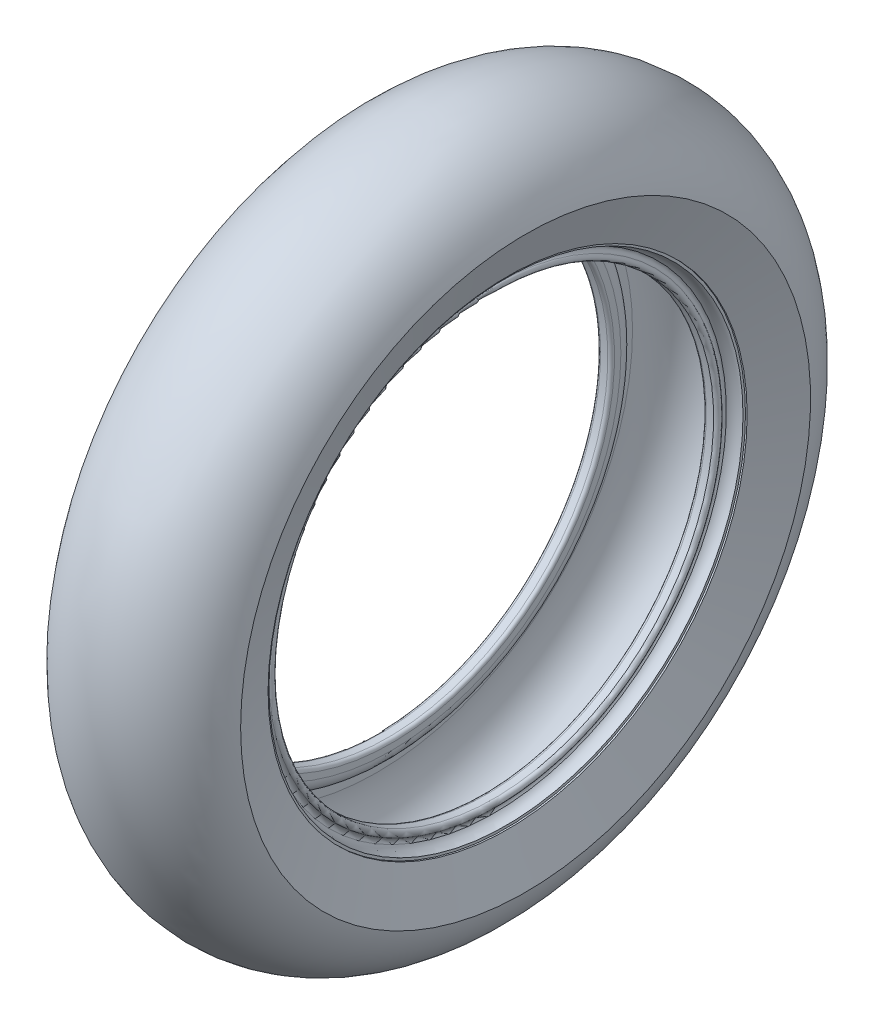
ISO-10303-21;
HEADER;
FILE_DESCRIPTION(('STEP AP214'),'2;1');
FILE_NAME('part.step','',(''),(''),'','','');
FILE_SCHEMA(('AUTOMOTIVE_DESIGN { 1 0 10303 214 1 1 1 1 }'));
ENDSEC;
DATA;
#1=APPLICATION_CONTEXT('core data for automotive mechanical design processes');
#2=APPLICATION_PROTOCOL_DEFINITION('international standard','automotive_design',2000,#1);
#3=PRODUCT_CONTEXT('',#1,'mechanical');
#4=PRODUCT('Part','Part','',(#3));
#5=PRODUCT_RELATED_PRODUCT_CATEGORY('part','',(#4));
#6=PRODUCT_DEFINITION_FORMATION('','',#4);
#7=PRODUCT_DEFINITION_CONTEXT('part definition',#1,'design');
#8=PRODUCT_DEFINITION('design','',#6,#7);
#9=PRODUCT_DEFINITION_SHAPE('','',#8);
#10=(LENGTH_UNIT() NAMED_UNIT(*) SI_UNIT(.MILLI.,.METRE.));
#11=(NAMED_UNIT(*) PLANE_ANGLE_UNIT() SI_UNIT($,.RADIAN.));
#12=(NAMED_UNIT(*) SI_UNIT($,.STERADIAN.) SOLID_ANGLE_UNIT());
#13=UNCERTAINTY_MEASURE_WITH_UNIT(LENGTH_MEASURE(1.E-05),#10,'distance_accuracy_value','');
#14=(GEOMETRIC_REPRESENTATION_CONTEXT(3) GLOBAL_UNCERTAINTY_ASSIGNED_CONTEXT((#13)) GLOBAL_UNIT_ASSIGNED_CONTEXT((#10,
#11,#12)) REPRESENTATION_CONTEXT('',''));
#15=CARTESIAN_POINT('',(0.,0.,0.));
#16=DIRECTION('',(0.,0.,1.));
#17=DIRECTION('',(1.,0.,0.));
#18=AXIS2_PLACEMENT_3D('',#15,#16,#17);
#19=CARTESIAN_POINT('',(0.,0.,0.));
#20=DIRECTION('',(-1.,0.,0.));
#21=DIRECTION('',(0.,0.,1.));
#22=AXIS2_PLACEMENT_3D('',#19,#20,#21);
#23=TOROIDAL_SURFACE('',#22,157.5,55.5);
#24=CARTESIAN_POINT('',(53.5,0.,0.));
#25=DIRECTION('',(-1.,0.,0.));
#26=DIRECTION('',(0.,0.,1.));
#27=AXIS2_PLACEMENT_3D('',#24,#25,#26);
#28=CIRCLE('',#27,172.264823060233);
#29=CARTESIAN_POINT('',(53.5,0.,172.264823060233));
#30=VERTEX_POINT('',#29);
#31=EDGE_CURVE('E126',#30,#30,#28,.T.);
#32=ORIENTED_EDGE('',*,*,#31,.T.);
#33=EDGE_LOOP('',(#32));
#34=FACE_BOUND('',#33,.T.);
#35=CARTESIAN_POINT('',(-53.5,0.,0.));
#36=DIRECTION('',(-1.,0.,0.));
#37=DIRECTION('',(0.,0.,1.));
#38=AXIS2_PLACEMENT_3D('',#35,#36,#37);
#39=CIRCLE('',#38,172.264823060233);
#40=CARTESIAN_POINT('',(-53.5,0.,172.264823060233));
#41=VERTEX_POINT('',#40);
#42=EDGE_CURVE('E123',#41,#41,#39,.T.);
#43=ORIENTED_EDGE('',*,*,#42,.F.);
#44=EDGE_LOOP('',(#43));
#45=FACE_BOUND('',#44,.T.);
#46=CARTESIAN_POINT('',(5.61746055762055,-10.,-212.479794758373));
#47=CARTESIAN_POINT('',(4.06799731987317,-10.,-212.637598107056));
#48=CARTESIAN_POINT('',(2.51158383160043,-10.,-212.730102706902));
#49=CARTESIAN_POINT('',(-0.603755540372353,-10.,-212.783739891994));
#50=CARTESIAN_POINT('',(-2.16268197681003,-10.,-212.744837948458));
#51=CARTESIAN_POINT('',(-5.2734850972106,-10.,-212.53578027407));
#52=CARTESIAN_POINT('',(-6.82535207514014,-10.,-212.365479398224));
#53=CARTESIAN_POINT('',(-9.9090910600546,-10.,-211.89467431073));
#54=CARTESIAN_POINT('',(-11.44096438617,-10.,-211.594178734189));
#55=CARTESIAN_POINT('',(-14.4732289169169,-10.,-210.86530716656));
#56=CARTESIAN_POINT('',(-15.9736344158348,-10.,-210.436990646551));
#57=CARTESIAN_POINT('',(-18.933053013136,-10.,-209.455478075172));
#58=CARTESIAN_POINT('',(-20.3920654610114,-10.,-208.902280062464));
#59=CARTESIAN_POINT('',(-23.2579451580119,-10.,-207.675115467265));
#60=CARTESIAN_POINT('',(-24.6648255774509,-10.,-207.001179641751));
#61=CARTESIAN_POINT('',(-27.4168455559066,-10.,-205.537255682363));
#62=CARTESIAN_POINT('',(-28.7619853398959,-10.,-204.747267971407));
#63=CARTESIAN_POINT('',(-31.3815035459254,-10.,-203.056542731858));
#64=CARTESIAN_POINT('',(-32.6558542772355,-10.,-202.155762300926));
#65=CARTESIAN_POINT('',(-35.1242000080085,-10.,-200.250117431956));
#66=CARTESIAN_POINT('',(-36.3181949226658,-10.,-199.245252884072));
#67=CARTESIAN_POINT('',(-38.6174237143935,-10.,-197.138558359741));
#68=CARTESIAN_POINT('',(-39.7226539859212,-10.,-196.036724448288));
#69=CARTESIAN_POINT('',(-41.8364881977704,-10.,-193.743971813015));
#70=CARTESIAN_POINT('',(-42.8450920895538,-10.,-192.553053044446));
#71=CARTESIAN_POINT('',(-44.7594080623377,-10.,-190.089507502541));
#72=CARTESIAN_POINT('',(-45.6650278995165,-10.,-188.816809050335));
#73=CARTESIAN_POINT('',(-47.3659524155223,-10.,-186.199716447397));
#74=CARTESIAN_POINT('',(-48.1612570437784,-10.,-184.855322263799));
#75=CARTESIAN_POINT('',(-49.6359570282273,-10.,-182.104395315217));
#76=CARTESIAN_POINT('',(-50.3153521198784,-10.,-180.697862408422));
#77=CARTESIAN_POINT('',(-51.5534654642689,-10.,-177.832650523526));
#78=CARTESIAN_POINT('',(-52.1121836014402,-10.,-176.373971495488));
#79=CARTESIAN_POINT('',(-53.1057284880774,-10.,-173.412757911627));
#80=CARTESIAN_POINT('',(-53.540382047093,-10.,-171.910165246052));
#81=CARTESIAN_POINT('',(-54.2817315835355,-10.,-168.873739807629));
#82=CARTESIAN_POINT('',(-54.5884274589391,-10.,-167.339907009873));
#83=CARTESIAN_POINT('',(-55.0717432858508,-10.,-164.251876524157));
#84=CARTESIAN_POINT('',(-55.2483626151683,-10.,-162.697678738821));
#85=CARTESIAN_POINT('',(-55.4703253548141,-10.,-159.579937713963));
#86=CARTESIAN_POINT('',(-55.5156686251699,-10.,-158.016394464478));
#87=CARTESIAN_POINT('',(-55.4747733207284,-10.,-154.88844396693));
#88=CARTESIAN_POINT('',(-55.3883171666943,-10.,-153.324039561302));
#89=CARTESIAN_POINT('',(-55.0840781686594,-10.,-150.208053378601));
#90=CARTESIAN_POINT('',(-54.8662951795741,-10.,-148.656471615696));
#91=CARTESIAN_POINT('',(-54.3009787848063,-10.,-145.577113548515));
#92=CARTESIAN_POINT('',(-53.9534441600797,-10.,-144.049337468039));
#93=CARTESIAN_POINT('',(-53.1311113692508,-10.,-141.028428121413));
#94=CARTESIAN_POINT('',(-52.6563131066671,-10.,-139.535294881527));
#95=CARTESIAN_POINT('',(-51.5820931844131,-10.,-136.592238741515));
#96=CARTESIAN_POINT('',(-50.9825022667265,-10.,-135.142377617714));
#97=CARTESIAN_POINT('',(-49.6633452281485,-10.,-132.298301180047));
#98=CARTESIAN_POINT('',(-48.94377896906,-10.,-130.904085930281));
#99=CARTESIAN_POINT('',(-47.389757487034,-10.,-128.18121370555));
#100=CARTESIAN_POINT('',(-46.5553015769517,-10.,-126.852557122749));
#101=CARTESIAN_POINT('',(-44.7773976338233,-10.,-124.270284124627));
#102=CARTESIAN_POINT('',(-43.8339496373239,-10.,-123.016667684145));
#103=CARTESIAN_POINT('',(-41.8446684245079,-10.,-120.593376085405));
#104=CARTESIAN_POINT('',(-40.7988299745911,-10.,-119.423705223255));
#105=CARTESIAN_POINT('',(-38.6121909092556,-10.,-117.176772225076));
#106=CARTESIAN_POINT('',(-37.4713902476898,-10.,-116.099510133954));
#107=CARTESIAN_POINT('',(-35.1028974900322,-10.,-114.045173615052));
#108=CARTESIAN_POINT('',(-33.8752058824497,-10.,-113.068098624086));
#109=CARTESIAN_POINT('',(-31.3416228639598,-10.,-111.221222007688));
#110=CARTESIAN_POINT('',(-30.0357316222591,-10.,-110.351420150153));
#111=CARTESIAN_POINT('',(-27.3581582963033,-10.,-108.72734295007));
#112=CARTESIAN_POINT('',(-25.9866369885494,-10.,-107.972802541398));
#113=CARTESIAN_POINT('',(-23.1847239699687,-10.,-106.58234360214));
#114=CARTESIAN_POINT('',(-21.7543323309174,-10.,-105.946424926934));
#115=CARTESIAN_POINT('',(-18.8448998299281,-10.,-104.797913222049));
#116=CARTESIAN_POINT('',(-17.3658600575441,-10.,-104.285317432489));
#117=CARTESIAN_POINT('',(-14.3696783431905,-10.,-103.387241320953));
#118=CARTESIAN_POINT('',(-12.8525365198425,-10.,-103.001760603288));
#119=CARTESIAN_POINT('',(-9.79745105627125,-10.,-102.36213575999));
#120=CARTESIAN_POINT('',(-8.25962112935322,-10.,-102.10744841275));
#121=CARTESIAN_POINT('',(-5.16794561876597,-10.,-101.728875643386));
#122=CARTESIAN_POINT('',(-3.61410008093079,-10.,-101.604989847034));
#123=CARTESIAN_POINT('',(-0.501524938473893,-10.,-101.48894533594));
#124=CARTESIAN_POINT('',(1.05720458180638,-10.,-101.496784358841));
#125=CARTESIAN_POINT('',(4.16842728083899,-10.,-101.644125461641));
#126=CARTESIAN_POINT('',(5.7209204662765,-10.,-101.783627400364));
#127=CARTESIAN_POINT('',(8.8043674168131,-10.,-102.192694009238));
#128=CARTESIAN_POINT('',(10.3353683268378,-10.,-102.461903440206));
#129=CARTESIAN_POINT('',(13.3692703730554,-10.,-103.128239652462));
#130=CARTESIAN_POINT('',(14.8721715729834,-10.,-103.525366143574));
#131=CARTESIAN_POINT('',(17.8392526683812,-10.,-104.444614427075));
#132=CARTESIAN_POINT('',(19.3034323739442,-10.,-104.966736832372));
#133=CARTESIAN_POINT('',(22.1827450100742,-10.,-106.132154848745));
#134=CARTESIAN_POINT('',(23.5978778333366,-10.,-106.775450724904));
#135=CARTESIAN_POINT('',(26.3713549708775,-10.,-108.179651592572));
#136=CARTESIAN_POINT('',(27.7296057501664,-10.,-108.940741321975));
#137=CARTESIAN_POINT('',(30.3774028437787,-10.,-110.574276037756));
#138=CARTESIAN_POINT('',(31.6669491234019,-10.,-111.446721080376));
#139=CARTESIAN_POINT('',(34.1683412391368,-10.,-113.296709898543));
#140=CARTESIAN_POINT('',(35.3801857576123,-10.,-114.274255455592));
#141=CARTESIAN_POINT('',(37.7177018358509,-10.,-116.327451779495));
#142=CARTESIAN_POINT('',(38.8433731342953,-10.,-117.403102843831));
#143=CARTESIAN_POINT('',(41.0052081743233,-10.,-119.649549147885));
#144=CARTESIAN_POINT('',(42.0409791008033,-10.,-120.820722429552));
#145=CARTESIAN_POINT('',(44.0104657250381,-10.,-123.245946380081));
#146=CARTESIAN_POINT('',(44.9441811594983,-10.,-124.499997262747));
#147=CARTESIAN_POINT('',(46.703023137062,-10.,-127.082089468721));
#148=CARTESIAN_POINT('',(47.5281483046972,-10.,-128.410131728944));
#149=CARTESIAN_POINT('',(49.0640086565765,-10.,-131.130791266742));
#150=CARTESIAN_POINT('',(49.7747436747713,-10.,-132.523408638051));
#151=CARTESIAN_POINT('',(51.0788325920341,-10.,-135.367750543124));
#152=CARTESIAN_POINT('',(51.6718188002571,-10.,-136.819643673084));
#153=CARTESIAN_POINT('',(52.733466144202,-10.,-139.768196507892));
#154=CARTESIAN_POINT('',(53.2021269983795,-10.,-141.264856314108));
#155=CARTESIAN_POINT('',(54.0117876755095,-10.,-144.292329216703));
#156=CARTESIAN_POINT('',(54.3527866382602,-10.,-145.823142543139));
#157=CARTESIAN_POINT('',(54.9046729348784,-10.,-148.90804610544));
#158=CARTESIAN_POINT('',(55.1155603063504,-10.,-150.462136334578));
#159=CARTESIAN_POINT('',(55.4057775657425,-10.,-153.583502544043));
#160=CARTESIAN_POINT('',(55.4850278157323,-10.,-155.150785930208));
#161=CARTESIAN_POINT('',(55.5111152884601,-10.,-158.286456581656));
#162=CARTESIAN_POINT('',(55.4579524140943,-10.,-159.854843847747));
#163=CARTESIAN_POINT('',(55.219542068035,-10.,-162.981547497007));
#164=CARTESIAN_POINT('',(55.0342946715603,-10.,-164.539863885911));
#165=CARTESIAN_POINT('',(54.5329821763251,-10.,-167.635310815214));
#166=CARTESIAN_POINT('',(54.2169172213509,-10.,-169.172441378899));
#167=CARTESIAN_POINT('',(53.456575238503,-10.,-172.212919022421));
#168=CARTESIAN_POINT('',(53.0124350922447,-10.,-173.716300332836));
#169=CARTESIAN_POINT('',(51.9989215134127,-10.,-176.680241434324));
#170=CARTESIAN_POINT('',(51.4295481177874,-10.,-178.140801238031));
#171=CARTESIAN_POINT('',(50.1696046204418,-10.,-181.008598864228));
#172=CARTESIAN_POINT('',(49.4790399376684,-10.,-182.415839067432));
#173=CARTESIAN_POINT('',(47.9815769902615,-10.,-185.166997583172));
#174=CARTESIAN_POINT('',(47.1746789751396,-10.,-186.510916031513));
#175=CARTESIAN_POINT('',(45.4517775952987,-10.,-189.123518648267));
#176=CARTESIAN_POINT('',(44.5359675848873,-10.,-190.392330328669));
#177=CARTESIAN_POINT('',(42.6005995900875,-10.,-192.848202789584));
#178=CARTESIAN_POINT('',(41.5810413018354,-10.,-194.035263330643));
#179=CARTESIAN_POINT('',(39.4451462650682,-10.,-196.319422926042));
#180=CARTESIAN_POINT('',(38.3287854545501,-10.,-197.416499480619));
#181=CARTESIAN_POINT('',(36.007458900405,-10.,-199.512486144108));
#182=CARTESIAN_POINT('',(34.8024946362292,-10.,-200.51139789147));
#183=CARTESIAN_POINT('',(32.3138383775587,-10.,-202.402918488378));
#184=CARTESIAN_POINT('',(31.030230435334,-10.,-203.2956379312));
#185=CARTESIAN_POINT('',(28.3921757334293,-10.,-204.969658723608));
#186=CARTESIAN_POINT('',(27.0377243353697,-10.,-205.750952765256));
#187=CARTESIAN_POINT('',(24.2693047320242,-10.,-207.195636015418));
#188=CARTESIAN_POINT('',(22.8554044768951,-10.,-207.859155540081));
#189=CARTESIAN_POINT('',(19.976918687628,-10.,-209.064502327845));
#190=CARTESIAN_POINT('',(18.5123466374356,-10.,-209.606361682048));
#191=CARTESIAN_POINT('',(16.1013383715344,-10.,-210.384458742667));
#192=CARTESIAN_POINT('',(15.1670760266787,-10.,-210.659015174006));
#193=CARTESIAN_POINT('',(13.2855471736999,-10.,-211.158529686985));
#194=CARTESIAN_POINT('',(12.3382835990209,-10.,-211.383498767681));
#195=CARTESIAN_POINT('',(10.4332270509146,-10.,-211.783257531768));
#196=CARTESIAN_POINT('',(9.47543408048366,-10.,-211.958047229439));
#197=CARTESIAN_POINT('',(7.55182062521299,-10.,-212.257001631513));
#198=CARTESIAN_POINT('',(6.58599840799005,-10.,-212.381155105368));
#199=CARTESIAN_POINT('',(5.61746055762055,-10.,-212.479794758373));
#200=B_SPLINE_CURVE_WITH_KNOTS('',3,(#46,#47,#48,#49,#50,#51,#52,#53,#54,#55,#56,#57,#58,#59,
#60,#61,#62,#63,#64,#65,#66,#67,#68,#69,#70,#71,#72,#73,#74,#75,#76,#77,#78,#79,#80,#81,#82,#83,
#84,#85,#86,#87,#88,#89,#90,#91,#92,#93,#94,#95,#96,#97,#98,#99,#100,#101,#102,#103,#104,#105,
#106,#107,#108,#109,#110,#111,#112,#113,#114,#115,#116,#117,#118,#119,#120,#121,#122,#123,#124,
#125,#126,#127,#128,#129,#130,#131,#132,#133,#134,#135,#136,#137,#138,#139,#140,#141,#142,#143,
#144,#145,#146,#147,#148,#149,#150,#151,#152,#153,#154,#155,#156,#157,#158,#159,#160,#161,#162,
#163,#164,#165,#166,#167,#168,#169,#170,#171,#172,#173,#174,#175,#176,#177,#178,#179,#180,#181,
#182,#183,#184,#185,#186,#187,#188,#189,#190,#191,#192,#193,#194,#195,#196,#197,#198,#199),
.UNSPECIFIED.,.T.,.F.,(4,2,2,2,2,2,2,2,2,2,2,2,2,2,2,2,2,2,2,2,2,2,2,2,2,2,2,2,2,2,2,2,2,2,2,2,
2,2,2,2,2,2,2,2,2,2,2,2,2,2,2,2,2,2,2,2,2,2,2,2,2,2,2,2,2,2,2,2,2,2,2,2,2,2,2,2,4),(0.,
4.67156865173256,9.34436491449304,14.0223302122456,18.6999852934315,23.3754673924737,
28.0510229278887,32.7253890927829,37.3997382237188,42.0759031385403,46.7520729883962,
51.42843268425,56.1047947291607,60.7853129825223,65.4658333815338,70.1463644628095,
74.8269000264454,79.513937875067,84.2009794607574,88.8880434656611,93.5751124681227,
98.2699274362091,102.964747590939,107.659611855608,112.35447967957,117.055757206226,
121.757040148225,126.458351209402,131.159660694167,135.861210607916,140.562762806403,
145.264288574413,149.965804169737,154.656339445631,159.346869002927,164.037293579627,
168.72770355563,173.398472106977,178.06922729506,182.739902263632,187.41057222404,
192.068522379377,196.726461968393,201.384424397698,206.042397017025,210.70775024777,
215.373105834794,220.038540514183,224.703989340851,229.388892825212,234.073808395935,
238.758783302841,243.443765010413,248.143153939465,252.842553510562,257.54198474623,
262.241414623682,266.943686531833,271.645961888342,276.34823456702,281.050502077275,
285.747762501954,290.44502154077,295.142070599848,299.839109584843,304.527930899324,
309.216765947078,313.906769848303,318.59669545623,323.28169319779,327.96699806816,
332.647085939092,337.325937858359,340.246042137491,343.165498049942,346.084953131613,
349.005055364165),.UNSPECIFIED.);
#201=CARTESIAN_POINT('',(41.3238701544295,-10.,-194.29127609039));
#202=VERTEX_POINT('',#201);
#203=CARTESIAN_POINT('',(0.,-10.,-212.76512872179));
#204=VERTEX_POINT('',#203);
#205=EDGE_CURVE('E11',#202,#204,#200,.T.);
#206=ORIENTED_EDGE('',*,*,#205,.F.);
#207=CARTESIAN_POINT('',(41.4721524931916,-5.95087564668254,-194.29127609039));
#208=CARTESIAN_POINT('',(41.5360222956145,-3.60541483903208,-194.29127609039));
#209=CARTESIAN_POINT('',(41.5619398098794,-1.25886034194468,-194.29127609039));
#210=CARTESIAN_POINT('',(41.5386744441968,3.43397851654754,-194.29127609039));
#211=CARTESIAN_POINT('',(41.4894873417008,5.78026285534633,-194.29127609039));
#212=CARTESIAN_POINT('',(41.314485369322,10.4718994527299,-194.29127609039));
#213=CARTESIAN_POINT('',(41.1886083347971,12.8172494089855,-194.29127609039));
#214=CARTESIAN_POINT('',(40.8565137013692,17.5022953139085,-194.29127609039));
#215=CARTESIAN_POINT('',(40.650298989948,19.8419914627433,-194.29127609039));
#216=CARTESIAN_POINT('',(40.2762871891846,23.3432526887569,-194.29127609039));
#217=CARTESIAN_POINT('',(40.1409236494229,24.50834510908,-194.29127609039));
#218=CARTESIAN_POINT('',(39.8476066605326,26.8356732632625,-194.29127609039));
#219=CARTESIAN_POINT('',(39.6896537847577,27.9979090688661,-194.29127609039));
#220=CARTESIAN_POINT('',(39.3499772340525,30.3190828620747,-194.29127609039));
#221=CARTESIAN_POINT('',(39.1682500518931,31.4780203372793,-194.29127609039));
#222=CARTESIAN_POINT('',(38.7797004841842,33.7916537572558,-194.29127609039));
#223=CARTESIAN_POINT('',(38.5728789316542,34.9463498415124,-194.29127609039));
#224=CARTESIAN_POINT('',(38.1328902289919,37.2491206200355,-194.29127609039));
#225=CARTESIAN_POINT('',(37.8997587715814,38.3972021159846,-194.29127609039));
#226=CARTESIAN_POINT('',(37.4051753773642,40.6872903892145,-194.29127609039));
#227=CARTESIAN_POINT('',(37.1437228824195,41.8292970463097,-194.29127609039));
#228=CARTESIAN_POINT('',(36.5906013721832,44.1056619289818,-194.29127609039));
#229=CARTESIAN_POINT('',(36.2989405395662,45.2400221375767,-194.29127609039));
#230=CARTESIAN_POINT('',(35.6831406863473,47.4998418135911,-194.29127609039));
#231=CARTESIAN_POINT('',(35.3590039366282,48.6253018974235,-194.29127609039));
#232=CARTESIAN_POINT('',(34.7230687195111,50.7103900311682,-194.29127609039));
#233=CARTESIAN_POINT('',(34.4157810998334,51.6713931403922,-194.29127609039));
#234=CARTESIAN_POINT('',(33.773470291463,53.5840740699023,-194.29127609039));
#235=CARTESIAN_POINT('',(33.4384480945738,54.5357522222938,-194.29127609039));
#236=CARTESIAN_POINT('',(32.7385892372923,56.4284838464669,-194.29127609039));
#237=CARTESIAN_POINT('',(32.3737422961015,57.3695335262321,-194.29127609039));
#238=CARTESIAN_POINT('',(31.6121927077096,59.2386878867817,-194.29127609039));
#239=CARTESIAN_POINT('',(31.2154901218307,60.1667925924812,-194.29127609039));
#240=CARTESIAN_POINT('',(30.3897699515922,62.0034884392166,-194.29127609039));
#241=CARTESIAN_POINT('',(29.9609074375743,62.9121490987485,-194.29127609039));
#242=CARTESIAN_POINT('',(29.0667648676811,64.7114903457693,-194.29127609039));
#243=CARTESIAN_POINT('',(28.601482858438,65.6021699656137,-194.29127609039));
#244=CARTESIAN_POINT('',(27.6321870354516,67.3613984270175,-194.29127609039));
#245=CARTESIAN_POINT('',(27.1282025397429,68.2299633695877,-194.29127609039));
#246=CARTESIAN_POINT('',(26.0784387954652,69.9413194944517,-194.29127609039));
#247=CARTESIAN_POINT('',(25.5326679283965,70.7841157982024,-194.29127609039));
#248=CARTESIAN_POINT('',(24.4160403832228,72.4102498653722,-194.29127609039));
#249=CARTESIAN_POINT('',(23.84671560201,73.1946360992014,-194.29127609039));
#250=CARTESIAN_POINT('',(22.6636588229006,74.7292055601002,-194.29127609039));
#251=CARTESIAN_POINT('',(22.0499308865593,75.4793919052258,-194.29127609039));
#252=CARTESIAN_POINT('',(20.7745144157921,76.9400527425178,-194.29127609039));
#253=CARTESIAN_POINT('',(20.1127536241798,77.6504644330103,-194.29127609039));
#254=CARTESIAN_POINT('',(18.7399469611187,79.0222472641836,-194.29127609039));
#255=CARTESIAN_POINT('',(18.0288999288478,79.6836172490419,-194.29127609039));
#256=CARTESIAN_POINT('',(16.5451791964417,80.9571221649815,-194.29127609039));
#257=CARTESIAN_POINT('',(15.7717451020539,81.5683766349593,-194.29127609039));
#258=CARTESIAN_POINT('',(14.1725622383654,82.7188648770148,-194.29127609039));
#259=CARTESIAN_POINT('',(13.3468077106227,83.2580907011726,-194.29127609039));
#260=CARTESIAN_POINT('',(11.6478660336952,84.2498537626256,-194.29127609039));
#261=CARTESIAN_POINT('',(10.7748318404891,84.7026513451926,-194.29127609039));
#262=CARTESIAN_POINT('',(8.98446897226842,85.5097862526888,-194.29127609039));
#263=CARTESIAN_POINT('',(8.06716872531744,85.8641858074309,-194.29127609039));
#264=CARTESIAN_POINT('',(6.50901078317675,86.3622891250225,-194.29127609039));
#265=CARTESIAN_POINT('',(5.87789726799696,86.5368494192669,-194.29127609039));
#266=CARTESIAN_POINT('',(4.60350952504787,86.8334987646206,-194.29127609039));
#267=CARTESIAN_POINT('',(3.96023846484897,86.9556012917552,-194.29127609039));
#268=CARTESIAN_POINT('',(2.66588638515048,87.1449059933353,-194.29127609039));
#269=CARTESIAN_POINT('',(2.0148082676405,87.2121279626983,-194.29127609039));
#270=CARTESIAN_POINT('',(0.709236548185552,87.2903608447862,-194.29127609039));
#271=CARTESIAN_POINT('',(0.0547428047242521,87.3013694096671,-194.29127609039));
#272=CARTESIAN_POINT('',(-1.25303812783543,87.2669244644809,-194.29127609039));
#273=CARTESIAN_POINT('',(-1.90632465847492,87.2214460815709,-194.29127609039));
#274=CARTESIAN_POINT('',(-3.20660767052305,87.0749442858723,-194.29127609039));
#275=CARTESIAN_POINT('',(-3.85360418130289,86.9739211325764,-194.29127609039));
#276=CARTESIAN_POINT('',(-5.13712813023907,86.7183288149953,-194.29127609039));
#277=CARTESIAN_POINT('',(-5.77365172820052,86.5637404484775,-194.29127609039));
#278=CARTESIAN_POINT('',(-7.03218500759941,86.2039541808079,-194.29127609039));
#279=CARTESIAN_POINT('',(-7.65419424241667,85.9987547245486,-194.29127609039));
#280=CARTESIAN_POINT('',(-8.88907339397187,85.5381236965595,-194.29127609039));
#281=CARTESIAN_POINT('',(-9.5016984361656,85.2820374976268,-194.29127609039));
#282=CARTESIAN_POINT('',(-10.7063529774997,84.7255955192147,-194.29127609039));
#283=CARTESIAN_POINT('',(-11.2983827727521,84.4252403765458,-194.29127609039));
#284=CARTESIAN_POINT('',(-13.0410740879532,83.4639635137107,-194.29127609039));
#285=CARTESIAN_POINT('',(-14.1586609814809,82.7427061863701,-194.29127609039));
#286=CARTESIAN_POINT('',(-17.0057912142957,80.6525633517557,-194.29127609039));
#287=CARTESIAN_POINT('',(-18.6522556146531,79.1704756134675,-194.29127609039));
#288=CARTESIAN_POINT('',(-20.9324679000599,76.7716268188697,-194.29127609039));
#289=CARTESIAN_POINT('',(-21.662114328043,75.9410485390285,-194.29127609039));
#290=CARTESIAN_POINT('',(-23.0622521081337,74.2310542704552,-194.29127609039));
#291=CARTESIAN_POINT('',(-23.7327472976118,73.3516414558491,-194.29127609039));
#292=CARTESIAN_POINT('',(-24.9198022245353,71.6907852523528,-194.29127609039));
#293=CARTESIAN_POINT('',(-25.4442310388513,70.9148966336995,-194.29127609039));
#294=CARTESIAN_POINT('',(-26.4557009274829,69.3390027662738,-194.29127609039));
#295=CARTESIAN_POINT('',(-26.9427374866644,68.5389946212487,-194.29127609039));
#296=CARTESIAN_POINT('',(-27.8819629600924,66.9181999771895,-194.29127609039));
#297=CARTESIAN_POINT('',(-28.3341303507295,66.0974010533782,-194.29127609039));
#298=CARTESIAN_POINT('',(-29.2055455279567,64.4385884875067,-194.29127609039));
#299=CARTESIAN_POINT('',(-29.6247943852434,63.6005754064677,-194.29127609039));
#300=CARTESIAN_POINT('',(-30.433182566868,61.9084749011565,-194.29127609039));
#301=CARTESIAN_POINT('',(-30.8222706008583,61.0543630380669,-194.29127609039));
#302=CARTESIAN_POINT('',(-31.5715463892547,59.3335904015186,-194.29127609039));
#303=CARTESIAN_POINT('',(-31.9317342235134,58.4669296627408,-194.29127609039));
#304=CARTESIAN_POINT('',(-32.6249544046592,56.7231111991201,-194.29127609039));
#305=CARTESIAN_POINT('',(-32.9579942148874,55.8459564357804,-194.29127609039));
#306=CARTESIAN_POINT('',(-33.5987191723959,54.08241381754,-194.29127609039));
#307=CARTESIAN_POINT('',(-33.9064027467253,53.1960253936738,-194.29127609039));
#308=CARTESIAN_POINT('',(-34.8059087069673,50.488483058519,-194.29127609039));
#309=CARTESIAN_POINT('',(-35.3601121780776,48.6547407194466,-194.29127609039));
#310=CARTESIAN_POINT('',(-36.3809947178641,44.9629569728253,-194.29127609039));
#311=CARTESIAN_POINT('',(-36.8476547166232,43.1049103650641,-194.29127609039));
#312=CARTESIAN_POINT('',(-37.7032296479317,39.3693323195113,-194.29127609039));
#313=CARTESIAN_POINT('',(-38.0920738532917,37.4917847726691,-194.29127609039));
#314=CARTESIAN_POINT('',(-38.7992759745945,33.7236983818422,-194.29127609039));
#315=CARTESIAN_POINT('',(-39.1176386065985,31.8331604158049,-194.29127609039));
#316=CARTESIAN_POINT('',(-39.6909815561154,28.037543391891,-194.29127609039));
#317=CARTESIAN_POINT('',(-39.9457952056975,26.132439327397,-194.29127609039));
#318=CARTESIAN_POINT('',(-40.3960093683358,22.3152509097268,-194.29127609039));
#319=CARTESIAN_POINT('',(-40.5914091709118,20.4031664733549,-194.29127609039));
#320=CARTESIAN_POINT('',(-40.9265571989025,16.5750732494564,-194.29127609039));
#321=CARTESIAN_POINT('',(-41.0663318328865,14.6590667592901,-194.29127609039));
#322=CARTESIAN_POINT('',(-41.2930932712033,10.8239524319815,-194.29127609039));
#323=CARTESIAN_POINT('',(-41.3800798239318,8.90484458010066,-194.29127609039));
#324=CARTESIAN_POINT('',(-41.5125343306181,4.76652839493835,-194.29127609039));
#325=CARTESIAN_POINT('',(-41.5494464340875,2.54704316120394,-194.29127609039));
#326=CARTESIAN_POINT('',(-41.5560694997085,-1.89206329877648,-194.29127609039));
#327=CARTESIAN_POINT('',(-41.5257790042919,-4.11168452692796,-194.29127609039));
#328=CARTESIAN_POINT('',(-41.3971630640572,-8.55023308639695,-194.29127609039));
#329=CARTESIAN_POINT('',(-41.2987990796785,-10.769159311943,-194.29127609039));
#330=CARTESIAN_POINT('',(-41.0314307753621,-15.2027563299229,-194.29127609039));
#331=CARTESIAN_POINT('',(-40.862427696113,-17.4174271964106,-194.29127609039));
#332=CARTESIAN_POINT('',(-40.4492536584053,-21.8408773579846,-194.29127609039));
#333=CARTESIAN_POINT('',(-40.2050460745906,-24.0496532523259,-194.29127609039));
#334=CARTESIAN_POINT('',(-39.6350408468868,-28.4569752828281,-194.29127609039));
#335=CARTESIAN_POINT('',(-39.3092381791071,-30.6555207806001,-194.29127609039));
#336=CARTESIAN_POINT('',(-38.7530057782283,-33.9408190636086,-194.29127609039));
#337=CARTESIAN_POINT('',(-38.5564381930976,-35.0333697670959,-194.29127609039));
#338=CARTESIAN_POINT('',(-38.1394306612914,-37.2138930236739,-194.29127609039));
#339=CARTESIAN_POINT('',(-37.9189915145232,-38.3018657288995,-194.29127609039));
#340=CARTESIAN_POINT('',(-37.4527956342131,-40.4722353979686,-194.29127609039));
#341=CARTESIAN_POINT('',(-37.2070422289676,-41.5546330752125,-194.29127609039));
#342=CARTESIAN_POINT('',(-36.6885365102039,-43.7129090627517,-194.29127609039));
#343=CARTESIAN_POINT('',(-36.4157852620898,-44.788787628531,-194.29127609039));
#344=CARTESIAN_POINT('',(-35.7965638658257,-47.1002562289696,-194.29127609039));
#345=CARTESIAN_POINT('',(-35.445233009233,-48.3345514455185,-194.29127609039));
#346=CARTESIAN_POINT('',(-34.700772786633,-50.7904037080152,-194.29127609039));
#347=CARTESIAN_POINT('',(-34.3076468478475,-52.0119617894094,-194.29127609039));
#348=CARTESIAN_POINT('',(-33.4755511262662,-54.4405572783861,-194.29127609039));
#349=CARTESIAN_POINT('',(-33.036543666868,-55.6475818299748,-194.29127609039));
#350=CARTESIAN_POINT('',(-32.1088074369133,-58.0424259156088,-194.29127609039));
#351=CARTESIAN_POINT('',(-31.6200796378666,-59.2302458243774,-194.29127609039));
#352=CARTESIAN_POINT('',(-30.5917796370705,-61.57404221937,-194.29127609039));
#353=CARTESIAN_POINT('',(-30.052580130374,-62.7301814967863,-194.29127609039));
#354=CARTESIAN_POINT('',(-28.9153715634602,-65.0135017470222,-194.29127609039));
#355=CARTESIAN_POINT('',(-28.3173550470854,-66.1406790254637,-194.29127609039));
#356=CARTESIAN_POINT('',(-27.0580742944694,-68.3567591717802,-194.29127609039));
#357=CARTESIAN_POINT('',(-26.3969203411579,-69.4457243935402,-194.29127609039));
#358=CARTESIAN_POINT('',(-25.004815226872,-71.5777528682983,-194.29127609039));
#359=CARTESIAN_POINT('',(-24.2738950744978,-72.6208362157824,-194.29127609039));
#360=CARTESIAN_POINT('',(-22.859945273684,-74.4860690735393,-194.29127609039));
#361=CARTESIAN_POINT('',(-22.1881792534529,-75.3167340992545,-194.29127609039));
#362=CARTESIAN_POINT('',(-20.7876758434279,-76.928868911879,-194.29127609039));
#363=CARTESIAN_POINT('',(-20.0589361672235,-77.7103367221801,-194.29127609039));
#364=CARTESIAN_POINT('',(-18.5427659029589,-79.2120933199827,-194.29127609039));
#365=CARTESIAN_POINT('',(-17.755436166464,-79.9324828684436,-194.29127609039));
#366=CARTESIAN_POINT('',(-16.5289749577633,-80.958062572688,-194.29127609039));
#367=CARTESIAN_POINT('',(-16.1126356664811,-81.2907141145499,-194.29127609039));
#368=CARTESIAN_POINT('',(-15.2645710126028,-81.9360476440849,-194.29127609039));
#369=CARTESIAN_POINT('',(-14.832842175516,-82.2487250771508,-194.29127609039));
#370=CARTESIAN_POINT('',(-13.7876828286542,-82.9664271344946,-194.29127609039));
#371=CARTESIAN_POINT('',(-13.1673927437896,-83.3615465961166,-194.29127609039));
#372=CARTESIAN_POINT('',(-11.89918860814,-84.1043483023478,-194.29127609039));
#373=CARTESIAN_POINT('',(-11.2512825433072,-84.4520441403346,-194.29127609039));
#374=CARTESIAN_POINT('',(-9.92983855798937,-85.0943719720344,-194.29127609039));
#375=CARTESIAN_POINT('',(-9.2563098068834,-85.3890227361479,-194.29127609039));
#376=CARTESIAN_POINT('',(-7.88646515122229,-85.9198314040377,-194.29127609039));
#377=CARTESIAN_POINT('',(-7.19014889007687,-86.1559883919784,-194.29127609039));
#378=CARTESIAN_POINT('',(-5.77282646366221,-86.5664993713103,-194.29127609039));
#379=CARTESIAN_POINT('',(-5.0516577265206,-86.7402953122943,-194.29127609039));
#380=CARTESIAN_POINT('',(-3.5960512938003,-87.0189421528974,-194.29127609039));
#381=CARTESIAN_POINT('',(-2.86161368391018,-87.1237934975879,-194.29127609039));
#382=CARTESIAN_POINT('',(-1.38639687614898,-87.2617715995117,-194.29127609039));
#383=CARTESIAN_POINT('',(-0.645621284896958,-87.2949367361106,-194.29127609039));
#384=CARTESIAN_POINT('',(0.835589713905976,-87.2887441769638,-194.29127609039));
#385=CARTESIAN_POINT('',(1.57602514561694,-87.24939284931,-194.29127609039));
#386=CARTESIAN_POINT('',(2.96054810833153,-87.108346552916,-194.29127609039));
#387=CARTESIAN_POINT('',(3.60547842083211,-87.0147492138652,-194.29127609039));
#388=CARTESIAN_POINT('',(4.88522580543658,-86.7742676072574,-194.29127609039));
#389=CARTESIAN_POINT('',(5.52004407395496,-86.6273896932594,-194.29127609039));
#390=CARTESIAN_POINT('',(6.77596736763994,-86.2830662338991,-194.29127609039));
#391=CARTESIAN_POINT('',(7.39706814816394,-86.0856052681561,-194.29127609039));
#392=CARTESIAN_POINT('',(8.62227031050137,-85.6435573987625,-194.29127609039));
#393=CARTESIAN_POINT('',(9.22636906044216,-85.3989632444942,-194.29127609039));
#394=CARTESIAN_POINT('',(10.604261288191,-84.7816889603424,-194.29127609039));
#395=CARTESIAN_POINT('',(11.3709152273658,-84.3930135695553,-194.29127609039));
#396=CARTESIAN_POINT('',(12.866782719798,-83.5493583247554,-194.29127609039));
#397=CARTESIAN_POINT('',(13.5959857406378,-83.0943599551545,-194.29127609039));
#398=CARTESIAN_POINT('',(15.0160623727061,-82.1261859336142,-194.29127609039));
#399=CARTESIAN_POINT('',(15.7068791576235,-81.6129272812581,-194.29127609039));
#400=CARTESIAN_POINT('',(17.0485873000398,-80.5368994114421,-194.29127609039));
#401=CARTESIAN_POINT('',(17.6994769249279,-79.9741280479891,-194.29127609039));
#402=CARTESIAN_POINT('',(19.2833120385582,-78.5089406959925,-194.29127609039));
#403=CARTESIAN_POINT('',(20.191244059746,-77.5794163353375,-194.29127609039));
#404=CARTESIAN_POINT('',(21.9222534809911,-75.6444539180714,-194.29127609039));
#405=CARTESIAN_POINT('',(22.7452852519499,-74.638975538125,-194.29127609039));
#406=CARTESIAN_POINT('',(24.3137237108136,-72.5665904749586,-194.29127609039));
#407=CARTESIAN_POINT('',(25.0589823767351,-71.4995724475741,-194.29127609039));
#408=CARTESIAN_POINT('',(26.4765259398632,-69.3185563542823,-194.29127609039));
#409=CARTESIAN_POINT('',(27.1488175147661,-68.2045626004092,-194.29127609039));
#410=CARTESIAN_POINT('',(28.3671449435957,-66.0450478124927,-194.29127609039));
#411=CARTESIAN_POINT('',(28.9191082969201,-65.0028475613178,-194.29127609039));
#412=CARTESIAN_POINT('',(29.9728346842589,-62.8932285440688,-194.29127609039));
#413=CARTESIAN_POINT('',(30.4745888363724,-61.8258053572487,-194.29127609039));
#414=CARTESIAN_POINT('',(31.4321603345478,-59.669732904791,-194.29127609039));
#415=CARTESIAN_POINT('',(31.8879450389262,-58.5810692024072,-194.29127609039));
#416=CARTESIAN_POINT('',(32.7568294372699,-56.3869641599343,-194.29127609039));
#417=CARTESIAN_POINT('',(33.1699313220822,-55.2815236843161,-194.29127609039));
#418=CARTESIAN_POINT('',(33.9572946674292,-53.0553297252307,-194.29127609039));
#419=CARTESIAN_POINT('',(34.3315050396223,-51.9345582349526,-194.29127609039));
#420=CARTESIAN_POINT('',(35.0434507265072,-49.6815168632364,-194.29127609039));
#421=CARTESIAN_POINT('',(35.3811857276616,-48.5492468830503,-194.29127609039));
#422=CARTESIAN_POINT('',(36.0227258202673,-46.2755766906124,-194.29127609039));
#423=CARTESIAN_POINT('',(36.3265423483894,-45.1341796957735,-194.29127609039));
#424=CARTESIAN_POINT('',(36.9027454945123,-42.8434691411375,-194.29127609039));
#425=CARTESIAN_POINT('',(37.1751310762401,-41.6941553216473,-194.29127609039));
#426=CARTESIAN_POINT('',(37.7497879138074,-39.1241329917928,-194.29127609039));
#427=CARTESIAN_POINT('',(38.0445453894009,-37.7017438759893,-194.29127609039));
#428=CARTESIAN_POINT('',(38.5931058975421,-34.8490971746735,-194.29127609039));
#429=CARTESIAN_POINT('',(38.846907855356,-33.4188393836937,-194.29127609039));
#430=CARTESIAN_POINT('',(39.3164842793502,-30.5518955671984,-194.29127609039));
#431=CARTESIAN_POINT('',(39.5322530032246,-29.1152086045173,-194.29127609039));
#432=CARTESIAN_POINT('',(39.9281624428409,-26.2369642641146,-194.29127609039));
#433=CARTESIAN_POINT('',(40.1083033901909,-24.7954069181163,-194.29127609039));
#434=CARTESIAN_POINT('',(40.4351458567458,-21.9071373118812,-194.29127609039));
#435=CARTESIAN_POINT('',(40.5818155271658,-20.4604214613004,-194.29127609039));
#436=CARTESIAN_POINT('',(40.8431457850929,-17.5641214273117,-194.29127609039));
#437=CARTESIAN_POINT('',(40.9578065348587,-16.1145372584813,-194.29127609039));
#438=CARTESIAN_POINT('',(41.1564002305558,-13.2133885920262,-194.29127609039));
#439=CARTESIAN_POINT('',(41.2403356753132,-11.7618242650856,-194.29127609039));
#440=CARTESIAN_POINT('',(41.3784230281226,-8.85727184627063,-194.29127609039));
#441=CARTESIAN_POINT('',(41.4325743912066,-7.40428372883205,-194.29127609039));
#442=CARTESIAN_POINT('',(41.4721524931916,-5.95087564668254,-194.29127609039));
#443=B_SPLINE_CURVE_WITH_KNOTS('',3,(#207,#208,#209,#210,#211,#212,#213,#214,#215,#216,#217,
#218,#219,#220,#221,#222,#223,#224,#225,#226,#227,#228,#229,#230,#231,#232,#233,#234,#235,#236,
#237,#238,#239,#240,#241,#242,#243,#244,#245,#246,#247,#248,#249,#250,#251,#252,#253,#254,#255,
#256,#257,#258,#259,#260,#261,#262,#263,#264,#265,#266,#267,#268,#269,#270,#271,#272,#273,#274,
#275,#276,#277,#278,#279,#280,#281,#282,#283,#284,#285,#286,#287,#288,#289,#290,#291,#292,#293,
#294,#295,#296,#297,#298,#299,#300,#301,#302,#303,#304,#305,#306,#307,#308,#309,#310,#311,#312,
#313,#314,#315,#316,#317,#318,#319,#320,#321,#322,#323,#324,#325,#326,#327,#328,#329,#330,#331,
#332,#333,#334,#335,#336,#337,#338,#339,#340,#341,#342,#343,#344,#345,#346,#347,#348,#349,#350,
#351,#352,#353,#354,#355,#356,#357,#358,#359,#360,#361,#362,#363,#364,#365,#366,#367,#368,#369,
#370,#371,#372,#373,#374,#375,#376,#377,#378,#379,#380,#381,#382,#383,#384,#385,#386,#387,#388,
#389,#390,#391,#392,#393,#394,#395,#396,#397,#398,#399,#400,#401,#402,#403,#404,#405,#406,#407,
#408,#409,#410,#411,#412,#413,#414,#415,#416,#417,#418,#419,#420,#421,#422,#423,#424,#425,#426,
#427,#428,#429,#430,#431,#432,#433,#434,#435,#436,#437,#438,#439,#440,#441,#442),.UNSPECIFIED.,
.T.,.F.,(4,2,2,2,2,2,2,2,2,2,2,2,2,2,2,2,2,2,2,2,2,2,2,2,2,2,2,2,2,2,2,2,2,2,2,2,2,2,2,2,2,2,2,
2,2,2,2,2,2,2,2,2,2,2,2,2,2,2,2,2,2,2,2,2,2,2,2,2,2,2,2,2,2,2,2,2,2,2,2,2,2,2,2,2,2,2,2,2,2,2,2,
2,2,2,2,2,2,2,2,2,2,2,2,2,2,2,2,2,2,2,2,2,2,2,2,2,2,4),(0.,7.03880268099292,14.0780011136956,
21.1229131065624,28.1675719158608,31.6861805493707,35.2046998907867,38.7237388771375,
42.2426610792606,45.7568655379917,49.2711392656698,52.7844635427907,56.2975423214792,
59.3239677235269,62.3502849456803,65.3776497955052,68.4050088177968,71.4186081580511,
74.4323692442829,77.4438694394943,80.4547671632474,83.3609830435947,86.2669334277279,
89.1773497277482,92.0878345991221,95.0416868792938,97.9958648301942,100.940998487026,
103.884265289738,105.846711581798,107.808653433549,109.769887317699,111.731203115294,
113.693382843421,115.655553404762,117.618428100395,119.581363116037,121.571408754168,
123.56142576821,127.540430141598,134.146265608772,137.461294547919,140.776108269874,
143.584571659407,146.393373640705,149.203895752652,152.014326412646,154.829436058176,
157.644537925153,160.458863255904,163.27336303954,169.017572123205,174.763031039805,
180.513688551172,186.263961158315,192.029159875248,197.794427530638,203.55695479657,
209.31950952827,215.977834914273,222.636304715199,229.29854727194,235.960672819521,
242.626048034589,249.291833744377,252.621894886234,255.951844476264,259.28135680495,
262.610737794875,266.460016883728,270.308980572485,274.161130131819,278.013204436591,
281.838793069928,285.664867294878,289.484376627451,293.302196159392,296.504780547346,
299.707493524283,302.904815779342,304.50304831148,306.101643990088,308.30601292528,
310.509748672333,312.712703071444,314.915691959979,317.137930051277,319.36015379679,
321.581187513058,323.802026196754,325.754826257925,327.70739352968,329.660556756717,
331.614020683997,334.188809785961,336.764319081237,339.343544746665,341.922882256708,
345.814741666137,349.708681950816,353.609903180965,357.510767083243,361.047342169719,
364.584541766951,368.12423560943,371.663747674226,375.207852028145,378.751986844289,
382.294923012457,385.837975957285,390.195124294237,394.552386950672,398.910306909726,
403.268198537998,407.630219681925,411.992218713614,416.353862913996,420.715586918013),.UNSPECIFIED.);
#444=CARTESIAN_POINT('',(41.5530023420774,0.,-194.29127609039));
#445=VERTEX_POINT('',#444);
#446=EDGE_CURVE('E60',#202,#445,#443,.T.);
#447=ORIENTED_EDGE('',*,*,#446,.T.);
#448=CARTESIAN_POINT('',(0.,0.,-157.5));
#449=DIRECTION('',(0.,1.,0.));
#450=DIRECTION('',(0.,0.,1.));
#451=AXIS2_PLACEMENT_3D('',#448,#449,#450);
#452=CIRCLE('',#451,55.5);
#453=CARTESIAN_POINT('',(0.,0.,-213.));
#454=VERTEX_POINT('',#453);
#455=EDGE_CURVE('E162',#445,#454,#452,.T.);
#456=ORIENTED_EDGE('',*,*,#455,.T.);
#457=CARTESIAN_POINT('',(0.,0.,0.));
#458=DIRECTION('',(-1.,0.,0.));
#459=DIRECTION('',(0.,0.,1.));
#460=AXIS2_PLACEMENT_3D('',#457,#458,#459);
#461=CIRCLE('',#460,213.);
#462=EDGE_CURVE('E45',#454,#204,#461,.T.);
#463=ORIENTED_EDGE('',*,*,#462,.T.);
#464=EDGE_LOOP('',(#206,#447,#456,#463));
#465=FACE_BOUND('',#464,.T.);
#466=ADVANCED_FACE('F33',(#34,#45,#465),#23,.T.);
#467=CARTESIAN_POINT('',(0.,0.,0.));
#468=DIRECTION('',(-1.,0.,0.));
#469=DIRECTION('',(0.,0.,1.));
#470=AXIS2_PLACEMENT_3D('',#467,#468,#469);
#471=TOROIDAL_SURFACE('',#470,157.5,36.4424855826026);
#472=CARTESIAN_POINT('',(36.316676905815,0.,0.));
#473=DIRECTION('',(-1.,0.,0.));
#474=DIRECTION('',(0.,0.,1.));
#475=AXIS2_PLACEMENT_3D('',#472,#473,#474);
#476=CIRCLE('',#475,154.474486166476);
#477=CARTESIAN_POINT('',(36.316676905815,0.,154.474486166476));
#478=VERTEX_POINT('',#477);
#479=EDGE_CURVE('E159',#478,#478,#476,.T.);
#480=ORIENTED_EDGE('',*,*,#479,.F.);
#481=EDGE_LOOP('',(#480));
#482=FACE_BOUND('',#481,.T.);
#483=CARTESIAN_POINT('',(-36.316676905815,0.,0.));
#484=DIRECTION('',(-1.,0.,0.));
#485=DIRECTION('',(0.,0.,1.));
#486=AXIS2_PLACEMENT_3D('',#483,#484,#485);
#487=CIRCLE('',#486,154.474486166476);
#488=CARTESIAN_POINT('',(-36.316676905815,0.,154.474486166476));
#489=VERTEX_POINT('',#488);
#490=EDGE_CURVE('E84',#489,#489,#487,.T.);
#491=ORIENTED_EDGE('',*,*,#490,.T.);
#492=EDGE_LOOP('',(#491));
#493=FACE_BOUND('',#492,.T.);
#494=ADVANCED_FACE('F35',(#482,#493),#471,.F.);
#495=CARTESIAN_POINT('',(36.316676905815,154.474486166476,0.));
#496=DIRECTION('',(1.,0.,0.));
#497=DIRECTION('',(0.,0.,-1.));
#498=AXIS2_PLACEMENT_3D('',#495,#496,#497);
#499=PLANE('',#498);
#500=CARTESIAN_POINT('',(36.316676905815,0.,0.));
#501=DIRECTION('',(-1.,0.,0.));
#502=DIRECTION('',(0.,0.,1.));
#503=AXIS2_PLACEMENT_3D('',#500,#501,#502);
#504=CIRCLE('',#503,147.478647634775);
#505=CARTESIAN_POINT('',(36.316676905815,0.,147.478647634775));
#506=VERTEX_POINT('',#505);
#507=EDGE_CURVE('E156',#506,#506,#504,.T.);
#508=ORIENTED_EDGE('',*,*,#507,.F.);
#509=EDGE_LOOP('',(#508));
#510=FACE_BOUND('',#509,.T.);
#511=ORIENTED_EDGE('',*,*,#479,.T.);
#512=EDGE_LOOP('',(#511));
#513=FACE_BOUND('',#512,.T.);
#514=ADVANCED_FACE('F233',(#510,#513),#499,.F.);
#515=CARTESIAN_POINT('',(36.3805974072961,0.,0.));
#516=DIRECTION('',(-1.,0.,0.));
#517=DIRECTION('',(0.,0.,1.));
#518=AXIS2_PLACEMENT_3D('',#515,#516,#517);
#519=TOROIDAL_SURFACE('',#518,138.869252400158,8.60963252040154);
#520=CARTESIAN_POINT('',(27.7709648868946,0.,0.));
#521=DIRECTION('',(-1.,0.,0.));
#522=DIRECTION('',(0.,0.,1.));
#523=AXIS2_PLACEMENT_3D('',#520,#521,#522);
#524=CIRCLE('',#523,138.869252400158);
#525=CARTESIAN_POINT('',(27.7709648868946,0.,138.869252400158));
#526=VERTEX_POINT('',#525);
#527=EDGE_CURVE('E153',#526,#526,#524,.T.);
#528=ORIENTED_EDGE('',*,*,#527,.F.);
#529=EDGE_LOOP('',(#528));
#530=FACE_BOUND('',#529,.T.);
#531=ORIENTED_EDGE('',*,*,#507,.T.);
#532=EDGE_LOOP('',(#531));
#533=FACE_BOUND('',#532,.T.);
#534=ADVANCED_FACE('F383',(#530,#533),#519,.T.);
#535=CARTESIAN_POINT('',(27.7709648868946,138.869252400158,0.));
#536=DIRECTION('',(1.,0.,0.));
#537=DIRECTION('',(0.,0.,-1.));
#538=AXIS2_PLACEMENT_3D('',#535,#536,#537);
#539=PLANE('',#538);
#540=CARTESIAN_POINT('',(27.7709648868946,0.,0.));
#541=DIRECTION('',(-1.,0.,0.));
#542=DIRECTION('',(0.,0.,1.));
#543=AXIS2_PLACEMENT_3D('',#540,#541,#542);
#544=CIRCLE('',#543,135.005600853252);
#545=CARTESIAN_POINT('',(27.7709648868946,0.,135.005600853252));
#546=VERTEX_POINT('',#545);
#547=EDGE_CURVE('E150',#546,#546,#544,.T.);
#548=ORIENTED_EDGE('',*,*,#547,.F.);
#549=EDGE_LOOP('',(#548));
#550=FACE_BOUND('',#549,.T.);
#551=ORIENTED_EDGE('',*,*,#527,.T.);
#552=EDGE_LOOP('',(#551));
#553=FACE_BOUND('',#552,.T.);
#554=ADVANCED_FACE('F373',(#550,#553),#539,.F.);
#555=CARTESIAN_POINT('',(29.7709648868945,0.,0.));
#556=DIRECTION('',(-1.,0.,0.));
#557=DIRECTION('',(0.,0.,1.));
#558=AXIS2_PLACEMENT_3D('',#555,#556,#557);
#559=TOROIDAL_SURFACE('',#558,135.005600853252,2.00000000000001);
#560=CARTESIAN_POINT('',(29.7709648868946,0.,0.));
#561=DIRECTION('',(-1.,0.,0.));
#562=DIRECTION('',(0.,0.,1.));
#563=AXIS2_PLACEMENT_3D('',#560,#561,#562);
#564=CIRCLE('',#563,133.005600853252);
#565=CARTESIAN_POINT('',(29.7709648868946,0.,133.005600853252));
#566=VERTEX_POINT('',#565);
#567=EDGE_CURVE('E147',#566,#566,#564,.T.);
#568=ORIENTED_EDGE('',*,*,#567,.F.);
#569=EDGE_LOOP('',(#568));
#570=FACE_BOUND('',#569,.T.);
#571=ORIENTED_EDGE('',*,*,#547,.T.);
#572=EDGE_LOOP('',(#571));
#573=FACE_BOUND('',#572,.T.);
#574=ADVANCED_FACE('F363',(#570,#573),#559,.T.);
#575=CARTESIAN_POINT('',(-62.5916551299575,0.,0.));
#576=DIRECTION('',(-1.,0.,0.));
#577=DIRECTION('',(0.,0.,1.));
#578=AXIS2_PLACEMENT_3D('',#575,#576,#577);
#579=CYLINDRICAL_SURFACE('',#578,133.005600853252);
#580=CARTESIAN_POINT('',(34.1696237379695,0.,0.));
#581=DIRECTION('',(-1.,0.,0.));
#582=DIRECTION('',(0.,0.,1.));
#583=AXIS2_PLACEMENT_3D('',#580,#581,#582);
#584=CIRCLE('',#583,133.005600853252);
#585=CARTESIAN_POINT('',(34.1696237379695,0.,133.005600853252));
#586=VERTEX_POINT('',#585);
#587=EDGE_CURVE('E144',#586,#586,#584,.T.);
#588=ORIENTED_EDGE('',*,*,#587,.F.);
#589=EDGE_LOOP('',(#588));
#590=FACE_BOUND('',#589,.T.);
#591=ORIENTED_EDGE('',*,*,#567,.T.);
#592=EDGE_LOOP('',(#591));
#593=FACE_BOUND('',#592,.T.);
#594=ADVANCED_FACE('F353',(#590,#593),#579,.F.);
#595=CARTESIAN_POINT('',(34.1696237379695,0.,0.));
#596=DIRECTION('',(-1.,0.,0.));
#597=DIRECTION('',(0.,0.,1.));
#598=AXIS2_PLACEMENT_3D('',#595,#596,#597);
#599=TOROIDAL_SURFACE('',#598,135.105600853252,2.10000000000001);
#600=CARTESIAN_POINT('',(35.2333153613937,0.,0.));
#601=DIRECTION('',(-1.,0.,0.));
#602=DIRECTION('',(0.,0.,1.));
#603=AXIS2_PLACEMENT_3D('',#600,#601,#602);
#604=CIRCLE('',#603,136.916280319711);
#605=CARTESIAN_POINT('',(35.2333153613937,0.,136.916280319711));
#606=VERTEX_POINT('',#605);
#607=EDGE_CURVE('E141',#606,#606,#604,.T.);
#608=ORIENTED_EDGE('',*,*,#607,.F.);
#609=EDGE_LOOP('',(#608));
#610=FACE_BOUND('',#609,.T.);
#611=ORIENTED_EDGE('',*,*,#587,.T.);
#612=EDGE_LOOP('',(#611));
#613=FACE_BOUND('',#612,.T.);
#614=ADVANCED_FACE('F343',(#610,#613),#599,.T.);
#615=CARTESIAN_POINT('',(36.3805974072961,0.,0.));
#616=DIRECTION('',(-1.,0.,0.));
#617=DIRECTION('',(0.,0.,1.));
#618=AXIS2_PLACEMENT_3D('',#615,#616,#617);
#619=TOROIDAL_SURFACE('',#618,138.869252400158,2.26502892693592);
#620=CARTESIAN_POINT('',(34.5956576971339,0.,0.));
#621=DIRECTION('',(-1.,0.,0.));
#622=DIRECTION('',(0.,0.,1.));
#623=AXIS2_PLACEMENT_3D('',#620,#621,#622);
#624=CIRCLE('',#623,140.263650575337);
#625=CARTESIAN_POINT('',(34.5956576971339,0.,140.263650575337));
#626=VERTEX_POINT('',#625);
#627=EDGE_CURVE('E138',#626,#626,#624,.T.);
#628=ORIENTED_EDGE('',*,*,#627,.F.);
#629=EDGE_LOOP('',(#628));
#630=FACE_BOUND('',#629,.T.);
#631=ORIENTED_EDGE('',*,*,#607,.T.);
#632=EDGE_LOOP('',(#631));
#633=FACE_BOUND('',#632,.T.);
#634=ADVANCED_FACE('F333',(#630,#633),#619,.F.);
#635=CARTESIAN_POINT('',(40.9,0.,0.));
#636=DIRECTION('',(-1.,0.,0.));
#637=DIRECTION('',(0.,0.,1.));
#638=AXIS2_PLACEMENT_3D('',#635,#636,#637);
#639=TOROIDAL_SURFACE('',#638,135.338686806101,8.00000000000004);
#640=CARTESIAN_POINT('',(41.6268291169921,0.,0.));
#641=DIRECTION('',(-1.,0.,0.));
#642=DIRECTION('',(0.,0.,1.));
#643=AXIS2_PLACEMENT_3D('',#640,#641,#642);
#644=CIRCLE('',#643,143.305600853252);
#645=CARTESIAN_POINT('',(41.6268291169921,0.,143.305600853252));
#646=VERTEX_POINT('',#645);
#647=EDGE_CURVE('E135',#646,#646,#644,.T.);
#648=ORIENTED_EDGE('',*,*,#647,.F.);
#649=EDGE_LOOP('',(#648));
#650=FACE_BOUND('',#649,.T.);
#651=ORIENTED_EDGE('',*,*,#627,.T.);
#652=EDGE_LOOP('',(#651));
#653=FACE_BOUND('',#652,.T.);
#654=ADVANCED_FACE('F323',(#650,#653),#639,.F.);
#655=CARTESIAN_POINT('',(41.6268291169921,143.305600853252,0.));
#656=DIRECTION('',(-1.,0.,0.));
#657=DIRECTION('',(0.,0.,1.));
#658=AXIS2_PLACEMENT_3D('',#655,#656,#657);
#659=PLANE('',#658);
#660=CARTESIAN_POINT('',(41.6268291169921,0.,0.));
#661=DIRECTION('',(-1.,0.,0.));
#662=DIRECTION('',(0.,0.,1.));
#663=AXIS2_PLACEMENT_3D('',#660,#661,#662);
#664=CIRCLE('',#663,144.805600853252);
#665=CARTESIAN_POINT('',(41.6268291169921,0.,144.805600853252));
#666=VERTEX_POINT('',#665);
#667=EDGE_CURVE('E132',#666,#666,#664,.T.);
#668=ORIENTED_EDGE('',*,*,#667,.F.);
#669=EDGE_LOOP('',(#668));
#670=FACE_BOUND('',#669,.T.);
#671=ORIENTED_EDGE('',*,*,#647,.T.);
#672=EDGE_LOOP('',(#671));
#673=FACE_BOUND('',#672,.T.);
#674=ADVANCED_FACE('F313',(#670,#673),#659,.F.);
#675=CARTESIAN_POINT('',(-62.5916551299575,0.,0.));
#676=DIRECTION('',(-1.,0.,0.));
#677=DIRECTION('',(0.,0.,1.));
#678=AXIS2_PLACEMENT_3D('',#675,#676,#677);
#679=CYLINDRICAL_SURFACE('',#678,144.805600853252);
#680=CARTESIAN_POINT('',(42.6268291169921,0.,0.));
#681=DIRECTION('',(-1.,0.,0.));
#682=DIRECTION('',(0.,0.,1.));
#683=AXIS2_PLACEMENT_3D('',#680,#681,#682);
#684=CIRCLE('',#683,144.805600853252);
#685=CARTESIAN_POINT('',(42.6268291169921,0.,144.805600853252));
#686=VERTEX_POINT('',#685);
#687=EDGE_CURVE('E129',#686,#686,#684,.T.);
#688=ORIENTED_EDGE('',*,*,#687,.F.);
#689=EDGE_LOOP('',(#688));
#690=FACE_BOUND('',#689,.T.);
#691=ORIENTED_EDGE('',*,*,#667,.T.);
#692=EDGE_LOOP('',(#691));
#693=FACE_BOUND('',#692,.T.);
#694=ADVANCED_FACE('F224',(#690,#693),#679,.F.);
#695=CARTESIAN_POINT('',(42.6268291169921,0.,0.));
#696=DIRECTION('',(1.,0.,0.));
#697=DIRECTION('',(0.,0.,-1.));
#698=AXIS2_PLACEMENT_3D('',#695,#696,#697);
#699=CONICAL_SURFACE('',#698,144.805600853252,1.19376441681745);
#700=ORIENTED_EDGE('',*,*,#31,.F.);
#701=EDGE_LOOP('',(#700));
#702=FACE_BOUND('',#701,.T.);
#703=ORIENTED_EDGE('',*,*,#687,.T.);
#704=EDGE_LOOP('',(#703));
#705=FACE_BOUND('',#704,.T.);
#706=ADVANCED_FACE('F219',(#702,#705),#699,.F.);
#707=CARTESIAN_POINT('',(-53.5,0.,0.));
#708=DIRECTION('',(-1.,0.,0.));
#709=DIRECTION('',(0.,0.,1.));
#710=AXIS2_PLACEMENT_3D('',#707,#708,#709);
#711=CONICAL_SURFACE('',#710,172.264823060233,1.19376441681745);
#712=CARTESIAN_POINT('',(-42.6268291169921,0.,0.));
#713=DIRECTION('',(-1.,0.,0.));
#714=DIRECTION('',(0.,0.,1.));
#715=AXIS2_PLACEMENT_3D('',#712,#713,#714);
#716=CIRCLE('',#715,144.805600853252);
#717=CARTESIAN_POINT('',(-42.6268291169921,0.,144.805600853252));
#718=VERTEX_POINT('',#717);
#719=EDGE_CURVE('E120',#718,#718,#716,.T.);
#720=ORIENTED_EDGE('',*,*,#719,.F.);
#721=EDGE_LOOP('',(#720));
#722=FACE_BOUND('',#721,.T.);
#723=ORIENTED_EDGE('',*,*,#42,.T.);
#724=EDGE_LOOP('',(#723));
#725=FACE_BOUND('',#724,.T.);
#726=ADVANCED_FACE('F216',(#722,#725),#711,.F.);
#727=CARTESIAN_POINT('',(-62.5916551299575,0.,0.));
#728=DIRECTION('',(-1.,0.,0.));
#729=DIRECTION('',(0.,0.,1.));
#730=AXIS2_PLACEMENT_3D('',#727,#728,#729);
#731=CYLINDRICAL_SURFACE('',#730,144.805600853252);
#732=CARTESIAN_POINT('',(-41.6268291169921,0.,0.));
#733=DIRECTION('',(-1.,0.,0.));
#734=DIRECTION('',(0.,0.,1.));
#735=AXIS2_PLACEMENT_3D('',#732,#733,#734);
#736=CIRCLE('',#735,144.805600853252);
#737=CARTESIAN_POINT('',(-41.6268291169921,0.,144.805600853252));
#738=VERTEX_POINT('',#737);
#739=EDGE_CURVE('E117',#738,#738,#736,.T.);
#740=ORIENTED_EDGE('',*,*,#739,.F.);
#741=EDGE_LOOP('',(#740));
#742=FACE_BOUND('',#741,.T.);
#743=ORIENTED_EDGE('',*,*,#719,.T.);
#744=EDGE_LOOP('',(#743));
#745=FACE_BOUND('',#744,.T.);
#746=ADVANCED_FACE('F213',(#742,#745),#731,.F.);
#747=CARTESIAN_POINT('',(-41.6268291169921,143.305600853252,0.));
#748=DIRECTION('',(1.,0.,0.));
#749=DIRECTION('',(0.,0.,-1.));
#750=AXIS2_PLACEMENT_3D('',#747,#748,#749);
#751=PLANE('',#750);
#752=CARTESIAN_POINT('',(-41.6268291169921,0.,0.));
#753=DIRECTION('',(-1.,0.,0.));
#754=DIRECTION('',(0.,0.,1.));
#755=AXIS2_PLACEMENT_3D('',#752,#753,#754);
#756=CIRCLE('',#755,143.305600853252);
#757=CARTESIAN_POINT('',(-41.6268291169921,0.,143.305600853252));
#758=VERTEX_POINT('',#757);
#759=EDGE_CURVE('E114',#758,#758,#756,.T.);
#760=ORIENTED_EDGE('',*,*,#759,.F.);
#761=EDGE_LOOP('',(#760));
#762=FACE_BOUND('',#761,.T.);
#763=ORIENTED_EDGE('',*,*,#739,.T.);
#764=EDGE_LOOP('',(#763));
#765=FACE_BOUND('',#764,.T.);
#766=ADVANCED_FACE('F209',(#762,#765),#751,.F.);
#767=CARTESIAN_POINT('',(-40.9,0.,0.));
#768=DIRECTION('',(-1.,0.,0.));
#769=DIRECTION('',(0.,0.,1.));
#770=AXIS2_PLACEMENT_3D('',#767,#768,#769);
#771=TOROIDAL_SURFACE('',#770,135.338686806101,8.00000000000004);
#772=CARTESIAN_POINT('',(-34.5956576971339,0.,0.));
#773=DIRECTION('',(-1.,0.,0.));
#774=DIRECTION('',(0.,0.,1.));
#775=AXIS2_PLACEMENT_3D('',#772,#773,#774);
#776=CIRCLE('',#775,140.263650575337);
#777=CARTESIAN_POINT('',(-34.5956576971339,0.,140.263650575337));
#778=VERTEX_POINT('',#777);
#779=EDGE_CURVE('E111',#778,#778,#776,.T.);
#780=ORIENTED_EDGE('',*,*,#779,.F.);
#781=EDGE_LOOP('',(#780));
#782=FACE_BOUND('',#781,.T.);
#783=ORIENTED_EDGE('',*,*,#759,.T.);
#784=EDGE_LOOP('',(#783));
#785=FACE_BOUND('',#784,.T.);
#786=ADVANCED_FACE('F205',(#782,#785),#771,.F.);
#787=CARTESIAN_POINT('',(-36.3805974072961,0.,0.));
#788=DIRECTION('',(-1.,0.,0.));
#789=DIRECTION('',(0.,0.,1.));
#790=AXIS2_PLACEMENT_3D('',#787,#788,#789);
#791=TOROIDAL_SURFACE('',#790,138.869252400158,2.26502892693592);
#792=CARTESIAN_POINT('',(-35.2333153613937,0.,0.));
#793=DIRECTION('',(-1.,0.,0.));
#794=DIRECTION('',(0.,0.,1.));
#795=AXIS2_PLACEMENT_3D('',#792,#793,#794);
#796=CIRCLE('',#795,136.916280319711);
#797=CARTESIAN_POINT('',(-35.2333153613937,0.,136.916280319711));
#798=VERTEX_POINT('',#797);
#799=EDGE_CURVE('E108',#798,#798,#796,.T.);
#800=ORIENTED_EDGE('',*,*,#799,.F.);
#801=EDGE_LOOP('',(#800));
#802=FACE_BOUND('',#801,.T.);
#803=ORIENTED_EDGE('',*,*,#779,.T.);
#804=EDGE_LOOP('',(#803));
#805=FACE_BOUND('',#804,.T.);
#806=ADVANCED_FACE('F201',(#802,#805),#791,.F.);
#807=CARTESIAN_POINT('',(-34.1696237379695,0.,0.));
#808=DIRECTION('',(-1.,0.,0.));
#809=DIRECTION('',(0.,0.,1.));
#810=AXIS2_PLACEMENT_3D('',#807,#808,#809);
#811=TOROIDAL_SURFACE('',#810,135.105600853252,2.10000000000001);
#812=CARTESIAN_POINT('',(-34.1696237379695,0.,0.));
#813=DIRECTION('',(-1.,0.,0.));
#814=DIRECTION('',(0.,0.,1.));
#815=AXIS2_PLACEMENT_3D('',#812,#813,#814);
#816=CIRCLE('',#815,133.005600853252);
#817=CARTESIAN_POINT('',(-34.1696237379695,0.,133.005600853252));
#818=VERTEX_POINT('',#817);
#819=EDGE_CURVE('E105',#818,#818,#816,.T.);
#820=ORIENTED_EDGE('',*,*,#819,.F.);
#821=EDGE_LOOP('',(#820));
#822=FACE_BOUND('',#821,.T.);
#823=ORIENTED_EDGE('',*,*,#799,.T.);
#824=EDGE_LOOP('',(#823));
#825=FACE_BOUND('',#824,.T.);
#826=ADVANCED_FACE('F197',(#822,#825),#811,.T.);
#827=CARTESIAN_POINT('',(-62.5916551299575,0.,0.));
#828=DIRECTION('',(-1.,0.,0.));
#829=DIRECTION('',(0.,0.,1.));
#830=AXIS2_PLACEMENT_3D('',#827,#828,#829);
#831=CYLINDRICAL_SURFACE('',#830,133.005600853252);
#832=CARTESIAN_POINT('',(-29.7709648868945,0.,0.));
#833=DIRECTION('',(-1.,0.,0.));
#834=DIRECTION('',(0.,0.,1.));
#835=AXIS2_PLACEMENT_3D('',#832,#833,#834);
#836=CIRCLE('',#835,133.005600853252);
#837=CARTESIAN_POINT('',(-29.7709648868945,0.,133.005600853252));
#838=VERTEX_POINT('',#837);
#839=EDGE_CURVE('E102',#838,#838,#836,.T.);
#840=ORIENTED_EDGE('',*,*,#839,.F.);
#841=EDGE_LOOP('',(#840));
#842=FACE_BOUND('',#841,.T.);
#843=ORIENTED_EDGE('',*,*,#819,.T.);
#844=EDGE_LOOP('',(#843));
#845=FACE_BOUND('',#844,.T.);
#846=ADVANCED_FACE('F193',(#842,#845),#831,.F.);
#847=CARTESIAN_POINT('',(-29.7709648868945,0.,0.));
#848=DIRECTION('',(-1.,0.,0.));
#849=DIRECTION('',(0.,0.,1.));
#850=AXIS2_PLACEMENT_3D('',#847,#848,#849);
#851=TOROIDAL_SURFACE('',#850,135.005600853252,2.00000000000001);
#852=CARTESIAN_POINT('',(-27.7709648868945,0.,0.));
#853=DIRECTION('',(-1.,0.,0.));
#854=DIRECTION('',(0.,0.,1.));
#855=AXIS2_PLACEMENT_3D('',#852,#853,#854);
#856=CIRCLE('',#855,135.005600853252);
#857=CARTESIAN_POINT('',(-27.7709648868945,0.,135.005600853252));
#858=VERTEX_POINT('',#857);
#859=EDGE_CURVE('E99',#858,#858,#856,.T.);
#860=ORIENTED_EDGE('',*,*,#859,.F.);
#861=EDGE_LOOP('',(#860));
#862=FACE_BOUND('',#861,.T.);
#863=ORIENTED_EDGE('',*,*,#839,.T.);
#864=EDGE_LOOP('',(#863));
#865=FACE_BOUND('',#864,.T.);
#866=ADVANCED_FACE('F189',(#862,#865),#851,.T.);
#867=CARTESIAN_POINT('',(-27.7709648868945,138.869252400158,0.));
#868=DIRECTION('',(-1.,0.,0.));
#869=DIRECTION('',(0.,0.,1.));
#870=AXIS2_PLACEMENT_3D('',#867,#868,#869);
#871=PLANE('',#870);
#872=CARTESIAN_POINT('',(-27.7709648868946,0.,0.));
#873=DIRECTION('',(-1.,0.,0.));
#874=DIRECTION('',(0.,0.,1.));
#875=AXIS2_PLACEMENT_3D('',#872,#873,#874);
#876=CIRCLE('',#875,138.869252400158);
#877=CARTESIAN_POINT('',(-27.7709648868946,0.,138.869252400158));
#878=VERTEX_POINT('',#877);
#879=EDGE_CURVE('E96',#878,#878,#876,.T.);
#880=ORIENTED_EDGE('',*,*,#879,.F.);
#881=EDGE_LOOP('',(#880));
#882=FACE_BOUND('',#881,.T.);
#883=ORIENTED_EDGE('',*,*,#859,.T.);
#884=EDGE_LOOP('',(#883));
#885=FACE_BOUND('',#884,.T.);
#886=ADVANCED_FACE('F185',(#882,#885),#871,.F.);
#887=CARTESIAN_POINT('',(-36.3805974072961,0.,0.));
#888=DIRECTION('',(-1.,0.,0.));
#889=DIRECTION('',(0.,0.,1.));
#890=AXIS2_PLACEMENT_3D('',#887,#888,#889);
#891=TOROIDAL_SURFACE('',#890,138.869252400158,8.60963252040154);
#892=CARTESIAN_POINT('',(-36.316676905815,0.,0.));
#893=DIRECTION('',(-1.,0.,0.));
#894=DIRECTION('',(0.,0.,1.));
#895=AXIS2_PLACEMENT_3D('',#892,#893,#894);
#896=CIRCLE('',#895,147.478647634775);
#897=CARTESIAN_POINT('',(-36.316676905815,0.,147.478647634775));
#898=VERTEX_POINT('',#897);
#899=EDGE_CURVE('E93',#898,#898,#896,.T.);
#900=ORIENTED_EDGE('',*,*,#899,.F.);
#901=EDGE_LOOP('',(#900));
#902=FACE_BOUND('',#901,.T.);
#903=ORIENTED_EDGE('',*,*,#879,.T.);
#904=EDGE_LOOP('',(#903));
#905=FACE_BOUND('',#904,.T.);
#906=ADVANCED_FACE('F181',(#902,#905),#891,.T.);
#907=CARTESIAN_POINT('',(-36.316676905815,147.478647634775,0.));
#908=DIRECTION('',(-1.,0.,0.));
#909=DIRECTION('',(0.,0.,1.));
#910=AXIS2_PLACEMENT_3D('',#907,#908,#909);
#911=PLANE('',#910);
#912=ORIENTED_EDGE('',*,*,#490,.F.);
#913=EDGE_LOOP('',(#912));
#914=FACE_BOUND('',#913,.T.);
#915=ORIENTED_EDGE('',*,*,#899,.T.);
#916=EDGE_LOOP('',(#915));
#917=FACE_BOUND('',#916,.T.);
#918=ADVANCED_FACE('F178',(#914,#917),#911,.F.);
#919=CARTESIAN_POINT('',(0.,-10.,-247.963451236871));
#920=DIRECTION('',(-1.,0.,0.));
#921=DIRECTION('',(0.,0.,1.));
#922=AXIS2_PLACEMENT_3D('',#919,#920,#921);
#923=PLANE('',#922);
#924=DIRECTION('',(0.,0.,1.));
#925=VECTOR('',#924,1.);
#926=CARTESIAN_POINT('',(0.,0.,-247.963451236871));
#927=LINE('',#926,#925);
#928=CARTESIAN_POINT('',(0.,0.,-194.29127609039));
#929=VERTEX_POINT('',#928);
#930=EDGE_CURVE('E52',#454,#929,#927,.T.);
#931=ORIENTED_EDGE('',*,*,#930,.T.);
#932=DIRECTION('',(0.,1.,0.));
#933=VECTOR('',#932,1.);
#934=CARTESIAN_POINT('',(0.,-10.,-194.29127609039));
#935=LINE('',#934,#933);
#936=CARTESIAN_POINT('',(0.,-10.,-194.29127609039));
#937=VERTEX_POINT('',#936);
#938=EDGE_CURVE('E82',#937,#929,#935,.T.);
#939=ORIENTED_EDGE('',*,*,#938,.F.);
#940=DIRECTION('',(0.,0.,1.));
#941=VECTOR('',#940,1.);
#942=CARTESIAN_POINT('',(0.,-10.,-247.963451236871));
#943=LINE('',#942,#941);
#944=EDGE_CURVE('E72',#204,#937,#943,.T.);
#945=ORIENTED_EDGE('',*,*,#944,.F.);
#946=ORIENTED_EDGE('',*,*,#462,.F.);
#947=EDGE_LOOP('',(#931,#939,#945,#946));
#948=FACE_BOUND('',#947,.T.);
#949=ADVANCED_FACE('F83',(#948),#923,.F.);
#950=CARTESIAN_POINT('',(0.,-10.,-194.29127609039));
#951=DIRECTION('',(0.,0.,1.));
#952=DIRECTION('',(1.,0.,0.));
#953=AXIS2_PLACEMENT_3D('',#950,#951,#952);
#954=PLANE('',#953);
#955=DIRECTION('',(1.,0.,0.));
#956=VECTOR('',#955,1.);
#957=CARTESIAN_POINT('',(0.,-10.,-194.29127609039));
#958=LINE('',#957,#956);
#959=EDGE_CURVE('E75',#937,#202,#958,.T.);
#960=ORIENTED_EDGE('',*,*,#959,.F.);
#961=ORIENTED_EDGE('',*,*,#938,.T.);
#962=DIRECTION('',(1.,0.,0.));
#963=VECTOR('',#962,1.);
#964=CARTESIAN_POINT('',(0.,0.,-194.29127609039));
#965=LINE('',#964,#963);
#966=EDGE_CURVE('E79',#929,#445,#965,.T.);
#967=ORIENTED_EDGE('',*,*,#966,.T.);
#968=ORIENTED_EDGE('',*,*,#446,.F.);
#969=EDGE_LOOP('',(#960,#961,#967,#968));
#970=FACE_BOUND('',#969,.T.);
#971=ADVANCED_FACE('F86',(#970),#954,.F.);
#972=CARTESIAN_POINT('',(0.,-10.,-194.29127609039));
#973=DIRECTION('',(0.,1.,0.));
#974=DIRECTION('',(0.,0.,1.));
#975=AXIS2_PLACEMENT_3D('',#972,#973,#974);
#976=PLANE('',#975);
#977=ORIENTED_EDGE('',*,*,#205,.T.);
#978=ORIENTED_EDGE('',*,*,#944,.T.);
#979=ORIENTED_EDGE('',*,*,#959,.T.);
#980=EDGE_LOOP('',(#977,#978,#979));
#981=FACE_BOUND('',#980,.T.);
#982=ADVANCED_FACE('F74',(#981),#976,.T.);
#983=CARTESIAN_POINT('',(0.,0.,-194.29127609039));
#984=DIRECTION('',(0.,1.,0.));
#985=DIRECTION('',(0.,0.,1.));
#986=AXIS2_PLACEMENT_3D('',#983,#984,#985);
#987=PLANE('',#986);
#988=ORIENTED_EDGE('',*,*,#966,.F.);
#989=ORIENTED_EDGE('',*,*,#930,.F.);
#990=ORIENTED_EDGE('',*,*,#455,.F.);
#991=EDGE_LOOP('',(#988,#989,#990));
#992=FACE_BOUND('',#991,.T.);
#993=ADVANCED_FACE('F175',(#992),#987,.F.);
#994=CLOSED_SHELL('',(#466,#494,#514,#534,#554,#574,#594,#614,#634,#654,#674,#694,#706,#726,
#746,#766,#786,#806,#826,#846,#866,#886,#906,#918,#949,#971,#982,#993));
#995=MANIFOLD_SOLID_BREP('B2',#994);
#996=ADVANCED_BREP_SHAPE_REPRESENTATION('',(#18,#995),#14);
#997=SHAPE_DEFINITION_REPRESENTATION(#9,#996);
ENDSEC;
END-ISO-10303-21;
